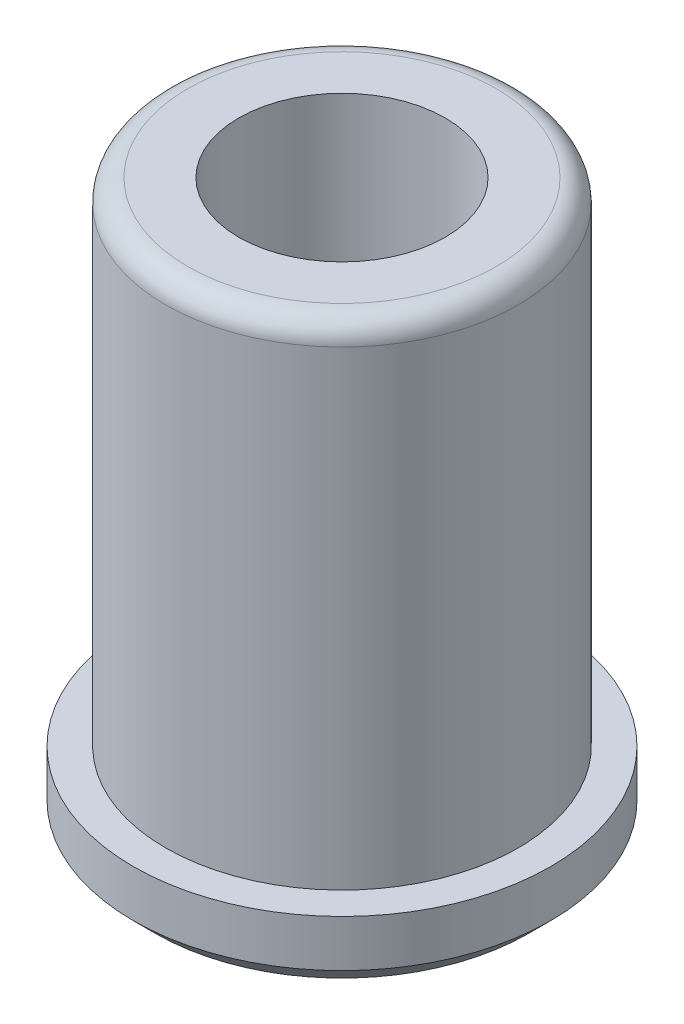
ISO-10303-21;
HEADER;
FILE_DESCRIPTION(('STEP AP214'),'2;1');
FILE_NAME('part.step','',(''),(''),'','','');
FILE_SCHEMA(('AUTOMOTIVE_DESIGN { 1 0 10303 214 1 1 1 1 }'));
ENDSEC;
DATA;
#1=APPLICATION_CONTEXT('core data for automotive mechanical design processes');
#2=APPLICATION_PROTOCOL_DEFINITION('international standard','automotive_design',2000,#1);
#3=PRODUCT_CONTEXT('',#1,'mechanical');
#4=PRODUCT('Part','Part','',(#3));
#5=PRODUCT_RELATED_PRODUCT_CATEGORY('part','',(#4));
#6=PRODUCT_DEFINITION_FORMATION('','',#4);
#7=PRODUCT_DEFINITION_CONTEXT('part definition',#1,'design');
#8=PRODUCT_DEFINITION('design','',#6,#7);
#9=PRODUCT_DEFINITION_SHAPE('','',#8);
#10=(LENGTH_UNIT() NAMED_UNIT(*) SI_UNIT(.MILLI.,.METRE.));
#11=(NAMED_UNIT(*) PLANE_ANGLE_UNIT() SI_UNIT($,.RADIAN.));
#12=(NAMED_UNIT(*) SI_UNIT($,.STERADIAN.) SOLID_ANGLE_UNIT());
#13=UNCERTAINTY_MEASURE_WITH_UNIT(LENGTH_MEASURE(1.E-05),#10,'distance_accuracy_value','');
#14=(GEOMETRIC_REPRESENTATION_CONTEXT(3) GLOBAL_UNCERTAINTY_ASSIGNED_CONTEXT((#13)) GLOBAL_UNIT_ASSIGNED_CONTEXT((#10,
#11,#12)) REPRESENTATION_CONTEXT('',''));
#15=CARTESIAN_POINT('',(0.,0.,0.));
#16=DIRECTION('',(0.,0.,1.));
#17=DIRECTION('',(1.,0.,0.));
#18=AXIS2_PLACEMENT_3D('',#15,#16,#17);
#19=CARTESIAN_POINT('',(0.,6.345,0.));
#20=DIRECTION('',(0.,-1.,0.));
#21=DIRECTION('',(0.,0.,-1.));
#22=AXIS2_PLACEMENT_3D('',#19,#20,#21);
#23=CYLINDRICAL_SURFACE('',#22,3.985);
#24=CARTESIAN_POINT('',(0.,5.845,0.));
#25=DIRECTION('',(0.,1.,0.));
#26=DIRECTION('',(0.,0.,1.));
#27=AXIS2_PLACEMENT_3D('',#24,#25,#26);
#28=CIRCLE('',#27,3.985);
#29=CARTESIAN_POINT('',(0.,5.845,3.985));
#30=VERTEX_POINT('',#29);
#31=EDGE_CURVE('E72',#30,#30,#28,.F.);
#32=ORIENTED_EDGE('',*,*,#31,.T.);
#33=EDGE_LOOP('',(#32));
#34=FACE_BOUND('',#33,.T.);
#35=CARTESIAN_POINT('',(0.,-4.785,0.));
#36=DIRECTION('',(0.,-1.,0.));
#37=DIRECTION('',(0.,0.,-1.));
#38=AXIS2_PLACEMENT_3D('',#35,#36,#37);
#39=CIRCLE('',#38,3.985);
#40=CARTESIAN_POINT('',(0.,-4.785,-3.985));
#41=VERTEX_POINT('',#40);
#42=EDGE_CURVE('E67',#41,#41,#39,.T.);
#43=ORIENTED_EDGE('',*,*,#42,.F.);
#44=EDGE_LOOP('',(#43));
#45=FACE_BOUND('',#44,.T.);
#46=ADVANCED_FACE('F44',(#34,#45),#23,.T.);
#47=CARTESIAN_POINT('',(0.,6.345,0.));
#48=DIRECTION('',(0.,1.,0.));
#49=DIRECTION('',(0.,0.,1.));
#50=AXIS2_PLACEMENT_3D('',#47,#48,#49);
#51=PLANE('',#50);
#52=CARTESIAN_POINT('',(0.,6.345,0.));
#53=DIRECTION('',(0.,1.,0.));
#54=DIRECTION('',(0.,0.,1.));
#55=AXIS2_PLACEMENT_3D('',#52,#53,#54);
#56=CIRCLE('',#55,3.485);
#57=CARTESIAN_POINT('',(0.,6.345,3.485));
#58=VERTEX_POINT('',#57);
#59=EDGE_CURVE('E76',#58,#58,#56,.T.);
#60=ORIENTED_EDGE('',*,*,#59,.T.);
#61=EDGE_LOOP('',(#60));
#62=FACE_BOUND('',#61,.T.);
#63=CARTESIAN_POINT('',(0.,6.345,0.));
#64=DIRECTION('',(0.,1.,0.));
#65=DIRECTION('',(0.,0.,1.));
#66=AXIS2_PLACEMENT_3D('',#63,#64,#65);
#67=CIRCLE('',#66,2.335);
#68=CARTESIAN_POINT('',(0.,6.345,2.335));
#69=VERTEX_POINT('',#68);
#70=EDGE_CURVE('E85',#69,#69,#67,.T.);
#71=ORIENTED_EDGE('',*,*,#70,.F.);
#72=EDGE_LOOP('',(#71));
#73=FACE_BOUND('',#72,.T.);
#74=ADVANCED_FACE('F110',(#62,#73),#51,.T.);
#75=CARTESIAN_POINT('',(0.,-6.345,0.));
#76=DIRECTION('',(0.,1.,0.));
#77=DIRECTION('',(0.,0.,1.));
#78=AXIS2_PLACEMENT_3D('',#75,#76,#77);
#79=PLANE('',#78);
#80=CARTESIAN_POINT('',(0.,-6.345,0.));
#81=DIRECTION('',(0.,1.,0.));
#82=DIRECTION('',(0.,0.,1.));
#83=AXIS2_PLACEMENT_3D('',#80,#81,#82);
#84=CIRCLE('',#83,2.835);
#85=CARTESIAN_POINT('',(0.,-6.345,2.835));
#86=VERTEX_POINT('',#85);
#87=EDGE_CURVE('E53',#86,#86,#84,.T.);
#88=ORIENTED_EDGE('',*,*,#87,.T.);
#89=EDGE_LOOP('',(#88));
#90=FACE_BOUND('',#89,.T.);
#91=CARTESIAN_POINT('',(0.,-6.345,0.));
#92=DIRECTION('',(0.,1.,0.));
#93=DIRECTION('',(0.,0.,1.));
#94=AXIS2_PLACEMENT_3D('',#91,#92,#93);
#95=CIRCLE('',#94,4.21500000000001);
#96=CARTESIAN_POINT('',(0.,-6.345,4.21500000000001));
#97=VERTEX_POINT('',#96);
#98=EDGE_CURVE('E61',#97,#97,#95,.F.);
#99=ORIENTED_EDGE('',*,*,#98,.T.);
#100=EDGE_LOOP('',(#99));
#101=FACE_BOUND('',#100,.T.);
#102=ADVANCED_FACE('F112',(#90,#101),#79,.F.);
#103=CARTESIAN_POINT('',(0.,6.345,0.));
#104=DIRECTION('',(0.,-1.,0.));
#105=DIRECTION('',(0.,0.,-1.));
#106=AXIS2_PLACEMENT_3D('',#103,#104,#105);
#107=CYLINDRICAL_SURFACE('',#106,2.335);
#108=CARTESIAN_POINT('',(0.,-5.845,0.));
#109=DIRECTION('',(0.,1.,0.));
#110=DIRECTION('',(0.,0.,1.));
#111=AXIS2_PLACEMENT_3D('',#108,#109,#110);
#112=CIRCLE('',#111,2.335);
#113=CARTESIAN_POINT('',(0.,-5.845,2.335));
#114=VERTEX_POINT('',#113);
#115=EDGE_CURVE('E10',#114,#114,#112,.F.);
#116=ORIENTED_EDGE('',*,*,#115,.T.);
#117=EDGE_LOOP('',(#116));
#118=FACE_BOUND('',#117,.T.);
#119=ORIENTED_EDGE('',*,*,#70,.T.);
#120=EDGE_LOOP('',(#119));
#121=FACE_BOUND('',#120,.T.);
#122=ADVANCED_FACE('F119',(#118,#121),#107,.F.);
#123=CARTESIAN_POINT('',(0.,5.845,0.));
#124=DIRECTION('',(0.,1.,0.));
#125=DIRECTION('',(0.,0.,1.));
#126=AXIS2_PLACEMENT_3D('',#123,#124,#125);
#127=TOROIDAL_SURFACE('',#126,3.485,0.5);
#128=ORIENTED_EDGE('',*,*,#31,.F.);
#129=EDGE_LOOP('',(#128));
#130=FACE_BOUND('',#129,.T.);
#131=ORIENTED_EDGE('',*,*,#59,.F.);
#132=EDGE_LOOP('',(#131));
#133=FACE_BOUND('',#132,.T.);
#134=ADVANCED_FACE('F104',(#130,#133),#127,.T.);
#135=CARTESIAN_POINT('',(0.,-4.785,0.));
#136=DIRECTION('',(0.,-1.,0.));
#137=DIRECTION('',(0.,0.,-1.));
#138=AXIS2_PLACEMENT_3D('',#135,#136,#137);
#139=CYLINDRICAL_SURFACE('',#138,4.715);
#140=CARTESIAN_POINT('',(0.,-5.84500000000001,0.));
#141=DIRECTION('',(0.,1.,0.));
#142=DIRECTION('',(0.,0.,1.));
#143=AXIS2_PLACEMENT_3D('',#140,#141,#142);
#144=CIRCLE('',#143,4.715);
#145=CARTESIAN_POINT('',(0.,-5.84500000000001,-4.715));
#146=VERTEX_POINT('',#145);
#147=EDGE_CURVE('E56',#146,#146,#144,.T.);
#148=CARTESIAN_POINT('',(0.,-4.785,0.));
#149=DIRECTION('',(0.,-1.,0.));
#150=DIRECTION('',(0.,0.,-1.));
#151=AXIS2_PLACEMENT_3D('',#148,#149,#150);
#152=CIRCLE('',#151,4.715);
#153=CARTESIAN_POINT('',(0.,-4.785,-4.715));
#154=VERTEX_POINT('',#153);
#155=EDGE_CURVE('E89',#154,#154,#152,.T.);
#156=CARTESIAN_POINT('',(0.,-5.84500000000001,-4.715));
#157=CARTESIAN_POINT('',(0.,-5.83395833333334,-4.715));
#158=CARTESIAN_POINT('',(0.,-5.82291666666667,-4.715));
#159=CARTESIAN_POINT('',(0.,-5.80083333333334,-4.715));
#160=CARTESIAN_POINT('',(0.,-5.78979166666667,-4.715));
#161=CARTESIAN_POINT('',(0.,-5.76770833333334,-4.715));
#162=CARTESIAN_POINT('',(0.,-5.75666666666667,-4.715));
#163=CARTESIAN_POINT('',(0.,-5.73458333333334,-4.715));
#164=CARTESIAN_POINT('',(0.,-5.72354166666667,-4.715));
#165=CARTESIAN_POINT('',(0.,-5.70145833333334,-4.715));
#166=CARTESIAN_POINT('',(0.,-5.69041666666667,-4.715));
#167=CARTESIAN_POINT('',(0.,-5.66833333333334,-4.715));
#168=CARTESIAN_POINT('',(0.,-5.65729166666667,-4.715));
#169=CARTESIAN_POINT('',(0.,-5.63520833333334,-4.715));
#170=CARTESIAN_POINT('',(0.,-5.62416666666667,-4.715));
#171=CARTESIAN_POINT('',(0.,-5.60208333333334,-4.715));
#172=CARTESIAN_POINT('',(0.,-5.59104166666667,-4.715));
#173=CARTESIAN_POINT('',(0.,-5.56895833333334,-4.715));
#174=CARTESIAN_POINT('',(0.,-5.55791666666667,-4.715));
#175=CARTESIAN_POINT('',(0.,-5.53583333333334,-4.715));
#176=CARTESIAN_POINT('',(0.,-5.52479166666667,-4.715));
#177=CARTESIAN_POINT('',(0.,-5.50270833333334,-4.715));
#178=CARTESIAN_POINT('',(0.,-5.49166666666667,-4.715));
#179=CARTESIAN_POINT('',(0.,-5.46958333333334,-4.715));
#180=CARTESIAN_POINT('',(0.,-5.45854166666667,-4.715));
#181=CARTESIAN_POINT('',(0.,-5.43645833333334,-4.715));
#182=CARTESIAN_POINT('',(0.,-5.42541666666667,-4.715));
#183=CARTESIAN_POINT('',(0.,-5.40333333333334,-4.715));
#184=CARTESIAN_POINT('',(0.,-5.39229166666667,-4.715));
#185=CARTESIAN_POINT('',(0.,-5.37020833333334,-4.715));
#186=CARTESIAN_POINT('',(0.,-5.35916666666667,-4.715));
#187=CARTESIAN_POINT('',(0.,-5.33708333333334,-4.715));
#188=CARTESIAN_POINT('',(0.,-5.32604166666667,-4.715));
#189=CARTESIAN_POINT('',(0.,-5.30395833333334,-4.715));
#190=CARTESIAN_POINT('',(0.,-5.29291666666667,-4.715));
#191=CARTESIAN_POINT('',(0.,-5.27083333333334,-4.715));
#192=CARTESIAN_POINT('',(0.,-5.25979166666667,-4.715));
#193=CARTESIAN_POINT('',(0.,-5.23770833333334,-4.715));
#194=CARTESIAN_POINT('',(0.,-5.22666666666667,-4.715));
#195=CARTESIAN_POINT('',(0.,-5.20458333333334,-4.715));
#196=CARTESIAN_POINT('',(0.,-5.19354166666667,-4.715));
#197=CARTESIAN_POINT('',(0.,-5.17145833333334,-4.715));
#198=CARTESIAN_POINT('',(0.,-5.16041666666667,-4.715));
#199=CARTESIAN_POINT('',(0.,-5.13833333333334,-4.715));
#200=CARTESIAN_POINT('',(0.,-5.12729166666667,-4.715));
#201=CARTESIAN_POINT('',(0.,-5.10520833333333,-4.715));
#202=CARTESIAN_POINT('',(0.,-5.09416666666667,-4.715));
#203=CARTESIAN_POINT('',(0.,-5.07208333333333,-4.715));
#204=CARTESIAN_POINT('',(0.,-5.06104166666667,-4.715));
#205=CARTESIAN_POINT('',(0.,-5.03895833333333,-4.715));
#206=CARTESIAN_POINT('',(0.,-5.02791666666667,-4.715));
#207=CARTESIAN_POINT('',(0.,-5.00583333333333,-4.715));
#208=CARTESIAN_POINT('',(0.,-4.99479166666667,-4.715));
#209=CARTESIAN_POINT('',(0.,-4.97270833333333,-4.715));
#210=CARTESIAN_POINT('',(0.,-4.96166666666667,-4.715));
#211=CARTESIAN_POINT('',(0.,-4.93958333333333,-4.715));
#212=CARTESIAN_POINT('',(0.,-4.92854166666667,-4.715));
#213=CARTESIAN_POINT('',(0.,-4.90645833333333,-4.715));
#214=CARTESIAN_POINT('',(0.,-4.89541666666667,-4.715));
#215=CARTESIAN_POINT('',(0.,-4.87333333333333,-4.715));
#216=CARTESIAN_POINT('',(0.,-4.86229166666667,-4.715));
#217=CARTESIAN_POINT('',(0.,-4.84020833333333,-4.715));
#218=CARTESIAN_POINT('',(0.,-4.82916666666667,-4.715));
#219=CARTESIAN_POINT('',(0.,-4.80708333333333,-4.715));
#220=CARTESIAN_POINT('',(0.,-4.79604166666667,-4.715));
#221=CARTESIAN_POINT('',(0.,-4.785,-4.715));
#222=B_SPLINE_CURVE_WITH_KNOTS('',3,(#156,#157,#158,#159,#160,#161,#162,#163,#164,#165,#166,
#167,#168,#169,#170,#171,#172,#173,#174,#175,#176,#177,#178,#179,#180,#181,#182,#183,#184,#185,
#186,#187,#188,#189,#190,#191,#192,#193,#194,#195,#196,#197,#198,#199,#200,#201,#202,#203,#204,
#205,#206,#207,#208,#209,#210,#211,#212,#213,#214,#215,#216,#217,#218,#219,#220,#221),
.UNSPECIFIED.,.F.,.F.,(4,2,2,2,2,2,2,2,2,2,2,2,2,2,2,2,2,2,2,2,2,2,2,2,2,2,2,2,2,2,2,2,4),(0.,
0.0331250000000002,0.0662500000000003,0.0993750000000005,0.132500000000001,0.165625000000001,
0.198750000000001,0.231875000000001,0.265000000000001,0.298125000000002,0.331250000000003,
0.364375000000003,0.397500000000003,0.430625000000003,0.463750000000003,0.496875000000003,
0.530000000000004,0.563125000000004,0.596250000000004,0.629375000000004,0.662500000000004,
0.695625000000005,0.728750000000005,0.761875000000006,0.795000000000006,0.828125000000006,
0.861250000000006,0.894375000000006,0.927500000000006,0.960625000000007,0.993750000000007,
1.02687500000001,1.06000000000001),.UNSPECIFIED.);
#223=EDGE_CURVE('BSEAM91',#146,#154,#222,.T.);
#224=ORIENTED_EDGE('',*,*,#147,.T.);
#225=ORIENTED_EDGE('',*,*,#155,.T.);
#226=ORIENTED_EDGE('',*,*,#223,.T.);
#227=ORIENTED_EDGE('',*,*,#223,.F.);
#228=EDGE_LOOP('',(#224,#226,#225,#227));
#229=FACE_BOUND('',#228,.T.);
#230=ADVANCED_FACE('F91',(#229),#139,.T.);
#231=CARTESIAN_POINT('',(0.,-4.785,0.));
#232=DIRECTION('',(0.,-1.,0.));
#233=DIRECTION('',(0.,0.,-1.));
#234=AXIS2_PLACEMENT_3D('',#231,#232,#233);
#235=PLANE('',#234);
#236=ORIENTED_EDGE('',*,*,#42,.T.);
#237=EDGE_LOOP('',(#236));
#238=FACE_BOUND('',#237,.T.);
#239=ORIENTED_EDGE('',*,*,#155,.F.);
#240=EDGE_LOOP('',(#239));
#241=FACE_BOUND('',#240,.T.);
#242=ADVANCED_FACE('F93',(#238,#241),#235,.F.);
#243=CARTESIAN_POINT('',(0.,-6.345,0.));
#244=DIRECTION('',(0.,1.,0.));
#245=DIRECTION('',(0.,0.,1.));
#246=AXIS2_PLACEMENT_3D('',#243,#244,#245);
#247=CONICAL_SURFACE('',#246,4.21500000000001,0.785398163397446);
#248=ORIENTED_EDGE('',*,*,#147,.F.);
#249=EDGE_LOOP('',(#248));
#250=FACE_BOUND('',#249,.T.);
#251=ORIENTED_EDGE('',*,*,#98,.F.);
#252=EDGE_LOOP('',(#251));
#253=FACE_BOUND('',#252,.T.);
#254=ADVANCED_FACE('F94',(#250,#253),#247,.T.);
#255=CARTESIAN_POINT('',(0.,-6.345,0.));
#256=DIRECTION('',(0.,-1.,0.));
#257=DIRECTION('',(0.,0.,-1.));
#258=AXIS2_PLACEMENT_3D('',#255,#256,#257);
#259=CONICAL_SURFACE('',#258,2.835,0.785398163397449);
#260=ORIENTED_EDGE('',*,*,#115,.F.);
#261=EDGE_LOOP('',(#260));
#262=FACE_BOUND('',#261,.T.);
#263=ORIENTED_EDGE('',*,*,#87,.F.);
#264=EDGE_LOOP('',(#263));
#265=FACE_BOUND('',#264,.T.);
#266=ADVANCED_FACE('F48',(#262,#265),#259,.F.);
#267=CLOSED_SHELL('',(#46,#74,#102,#122,#134,#230,#242,#254,#266));
#268=MANIFOLD_SOLID_BREP('B2',#267);
#269=ADVANCED_BREP_SHAPE_REPRESENTATION('',(#18,#268),#14);
#270=SHAPE_DEFINITION_REPRESENTATION(#9,#269);
ENDSEC;
END-ISO-10303-21;
